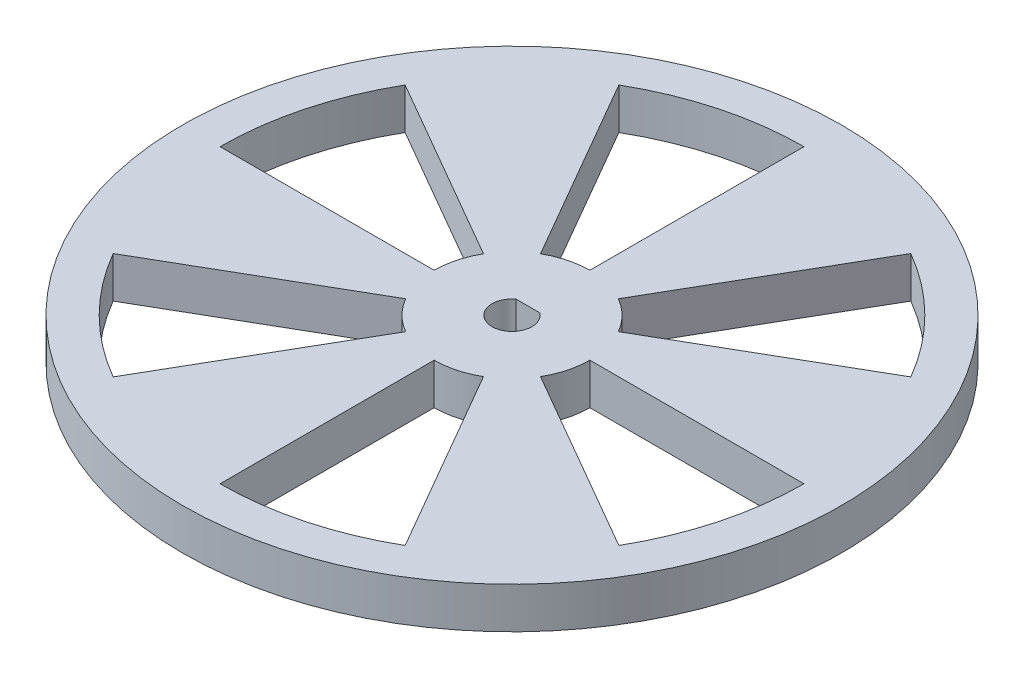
ISO-10303-21;
HEADER;
FILE_DESCRIPTION(('STEP AP214'),'2;1');
FILE_NAME('part.step','',(''),(''),'','','');
FILE_SCHEMA(('AUTOMOTIVE_DESIGN { 1 0 10303 214 1 1 1 1 }'));
ENDSEC;
DATA;
#1=APPLICATION_CONTEXT('core data for automotive mechanical design processes');
#2=APPLICATION_PROTOCOL_DEFINITION('international standard','automotive_design',2000,#1);
#3=PRODUCT_CONTEXT('',#1,'mechanical');
#4=PRODUCT('Part','Part','',(#3));
#5=PRODUCT_RELATED_PRODUCT_CATEGORY('part','',(#4));
#6=PRODUCT_DEFINITION_FORMATION('','',#4);
#7=PRODUCT_DEFINITION_CONTEXT('part definition',#1,'design');
#8=PRODUCT_DEFINITION('design','',#6,#7);
#9=PRODUCT_DEFINITION_SHAPE('','',#8);
#10=(LENGTH_UNIT() NAMED_UNIT(*) SI_UNIT(.MILLI.,.METRE.));
#11=(NAMED_UNIT(*) PLANE_ANGLE_UNIT() SI_UNIT($,.RADIAN.));
#12=(NAMED_UNIT(*) SI_UNIT($,.STERADIAN.) SOLID_ANGLE_UNIT());
#13=UNCERTAINTY_MEASURE_WITH_UNIT(LENGTH_MEASURE(1.E-05),#10,'distance_accuracy_value','');
#14=(GEOMETRIC_REPRESENTATION_CONTEXT(3) GLOBAL_UNCERTAINTY_ASSIGNED_CONTEXT((#13)) GLOBAL_UNIT_ASSIGNED_CONTEXT((#10,
#11,#12)) REPRESENTATION_CONTEXT('',''));
#15=CARTESIAN_POINT('',(0.,0.,0.));
#16=DIRECTION('',(0.,0.,1.));
#17=DIRECTION('',(1.,0.,0.));
#18=AXIS2_PLACEMENT_3D('',#15,#16,#17);
#19=CARTESIAN_POINT('',(0.,6.35,0.));
#20=DIRECTION('',(0.,1.,0.));
#21=DIRECTION('',(0.,0.,1.));
#22=AXIS2_PLACEMENT_3D('',#19,#20,#21);
#23=PLANE('',#22);
#24=DIRECTION('',(-0.499999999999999,0.,0.866025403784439));
#25=VECTOR('',#24,1.);
#26=CARTESIAN_POINT('',(5.99999999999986,6.35,-10.3923048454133));
#27=LINE('',#26,#25);
#28=CARTESIAN_POINT('',(22.4999999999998,6.35,-38.9711431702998));
#29=VERTEX_POINT('',#28);
#30=CARTESIAN_POINT('',(5.99999999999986,6.35,-10.3923048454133));
#31=VERTEX_POINT('',#30);
#32=EDGE_CURVE('E242',#29,#31,#27,.T.);
#33=ORIENTED_EDGE('',*,*,#32,.F.);
#34=CARTESIAN_POINT('',(0.,6.35,0.));
#35=DIRECTION('',(0.,1.,0.));
#36=DIRECTION('',(0.,0.,1.));
#37=AXIS2_PLACEMENT_3D('',#34,#35,#36);
#38=CIRCLE('',#37,45.);
#39=CARTESIAN_POINT('',(38.9711431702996,6.35,-22.5000000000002));
#40=VERTEX_POINT('',#39);
#41=EDGE_CURVE('E240',#40,#29,#38,.T.);
#42=ORIENTED_EDGE('',*,*,#41,.F.);
#43=DIRECTION('',(0.866025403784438,0.,-0.500000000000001));
#44=VECTOR('',#43,1.);
#45=CARTESIAN_POINT('',(10.3923048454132,6.35,-6.00000000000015));
#46=LINE('',#45,#44);
#47=CARTESIAN_POINT('',(10.3923048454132,6.35,-6.00000000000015));
#48=VERTEX_POINT('',#47);
#49=EDGE_CURVE('E248',#48,#40,#46,.T.);
#50=ORIENTED_EDGE('',*,*,#49,.F.);
#51=CARTESIAN_POINT('',(0.,6.35,0.));
#52=DIRECTION('',(0.,-1.,0.));
#53=DIRECTION('',(0.,0.,1.));
#54=AXIS2_PLACEMENT_3D('',#51,#52,#53);
#55=CIRCLE('',#54,12.);
#56=EDGE_CURVE('E245',#31,#48,#55,.T.);
#57=ORIENTED_EDGE('',*,*,#56,.F.);
#58=EDGE_LOOP('',(#33,#42,#50,#57));
#59=FACE_BOUND('',#58,.T.);
#60=DIRECTION('',(-1.,0.,0.));
#61=VECTOR('',#60,1.);
#62=CARTESIAN_POINT('',(1.83187666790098,6.35,-2.46356));
#63=LINE('',#62,#61);
#64=CARTESIAN_POINT('',(1.83187666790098,6.35,-2.46356));
#65=VERTEX_POINT('',#64);
#66=CARTESIAN_POINT('',(-1.83187666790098,6.35,-2.46356));
#67=VERTEX_POINT('',#66);
#68=EDGE_CURVE('E305',#65,#67,#63,.T.);
#69=ORIENTED_EDGE('',*,*,#68,.F.);
#70=CARTESIAN_POINT('',(0.,6.35,0.));
#71=DIRECTION('',(0.,1.,0.));
#72=DIRECTION('',(0.,0.,1.));
#73=AXIS2_PLACEMENT_3D('',#70,#71,#72);
#74=CIRCLE('',#73,3.07);
#75=EDGE_CURVE('E302',#67,#65,#74,.T.);
#76=ORIENTED_EDGE('',*,*,#75,.F.);
#77=EDGE_LOOP('',(#69,#76));
#78=FACE_BOUND('',#77,.T.);
#79=DIRECTION('',(0.5,0.,0.866025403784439));
#80=VECTOR('',#79,1.);
#81=CARTESIAN_POINT('',(-5.99999999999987,6.35,-10.3923048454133));
#82=LINE('',#81,#80);
#83=CARTESIAN_POINT('',(-22.4999999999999,6.35,-38.9711431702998));
#84=VERTEX_POINT('',#83);
#85=CARTESIAN_POINT('',(-5.99999999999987,6.35,-10.3923048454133));
#86=VERTEX_POINT('',#85);
#87=EDGE_CURVE('E352',#84,#86,#82,.T.);
#88=ORIENTED_EDGE('',*,*,#87,.F.);
#89=CARTESIAN_POINT('',(0.,6.35,0.));
#90=DIRECTION('',(0.,1.,0.));
#91=DIRECTION('',(0.,0.,1.));
#92=AXIS2_PLACEMENT_3D('',#89,#90,#91);
#93=CIRCLE('',#92,45.);
#94=CARTESIAN_POINT('',(-2.02076517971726E-13,6.35,-45.));
#95=VERTEX_POINT('',#94);
#96=EDGE_CURVE('E350',#95,#84,#93,.T.);
#97=ORIENTED_EDGE('',*,*,#96,.F.);
#98=DIRECTION('',(0.,0.,-1.));
#99=VECTOR('',#98,1.);
#100=CARTESIAN_POINT('',(-1.66061953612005E-13,6.35,-12.));
#101=LINE('',#100,#99);
#102=CARTESIAN_POINT('',(-1.66061953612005E-13,6.35,-12.));
#103=VERTEX_POINT('',#102);
#104=EDGE_CURVE('E358',#103,#95,#101,.T.);
#105=ORIENTED_EDGE('',*,*,#104,.F.);
#106=CARTESIAN_POINT('',(0.,6.35,0.));
#107=DIRECTION('',(0.,-1.,0.));
#108=DIRECTION('',(0.,0.,1.));
#109=AXIS2_PLACEMENT_3D('',#106,#107,#108);
#110=CIRCLE('',#109,12.);
#111=EDGE_CURVE('E355',#86,#103,#110,.T.);
#112=ORIENTED_EDGE('',*,*,#111,.F.);
#113=EDGE_LOOP('',(#88,#97,#105,#112));
#114=FACE_BOUND('',#113,.T.);
#115=CARTESIAN_POINT('',(0.,6.35,0.));
#116=DIRECTION('',(0.,1.,0.));
#117=DIRECTION('',(0.,0.,1.));
#118=AXIS2_PLACEMENT_3D('',#115,#116,#117);
#119=CIRCLE('',#118,50.8);
#120=CARTESIAN_POINT('',(0.,6.35,50.8));
#121=VERTEX_POINT('',#120);
#122=EDGE_CURVE('E11',#121,#121,#119,.T.);
#123=ORIENTED_EDGE('',*,*,#122,.T.);
#124=EDGE_LOOP('',(#123));
#125=FACE_BOUND('',#124,.T.);
#126=DIRECTION('',(-0.866025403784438,0.,0.500000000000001));
#127=VECTOR('',#126,1.);
#128=CARTESIAN_POINT('',(-10.3923048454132,6.35,6.00000000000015));
#129=LINE('',#128,#127);
#130=CARTESIAN_POINT('',(-10.3923048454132,6.35,6.00000000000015));
#131=VERTEX_POINT('',#130);
#132=CARTESIAN_POINT('',(-38.9711431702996,6.35,22.5000000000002));
#133=VERTEX_POINT('',#132);
#134=EDGE_CURVE('E383',#131,#133,#129,.T.);
#135=ORIENTED_EDGE('',*,*,#134,.F.);
#136=CARTESIAN_POINT('',(0.,6.35,0.));
#137=DIRECTION('',(0.,-1.,0.));
#138=DIRECTION('',(0.,0.,1.));
#139=AXIS2_PLACEMENT_3D('',#136,#137,#138);
#140=CIRCLE('',#139,12.);
#141=CARTESIAN_POINT('',(-5.99999999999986,6.35,10.3923048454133));
#142=VERTEX_POINT('',#141);
#143=EDGE_CURVE('E381',#142,#131,#140,.T.);
#144=ORIENTED_EDGE('',*,*,#143,.F.);
#145=DIRECTION('',(0.499999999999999,0.,-0.866025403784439));
#146=VECTOR('',#145,1.);
#147=CARTESIAN_POINT('',(-5.99999999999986,6.35,10.3923048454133));
#148=LINE('',#147,#146);
#149=CARTESIAN_POINT('',(-22.4999999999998,6.35,38.9711431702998));
#150=VERTEX_POINT('',#149);
#151=EDGE_CURVE('E389',#150,#142,#148,.T.);
#152=ORIENTED_EDGE('',*,*,#151,.F.);
#153=CARTESIAN_POINT('',(0.,6.35,0.));
#154=DIRECTION('',(0.,1.,0.));
#155=DIRECTION('',(0.,0.,1.));
#156=AXIS2_PLACEMENT_3D('',#153,#154,#155);
#157=CIRCLE('',#156,45.);
#158=EDGE_CURVE('E386',#133,#150,#157,.T.);
#159=ORIENTED_EDGE('',*,*,#158,.F.);
#160=EDGE_LOOP('',(#135,#144,#152,#159));
#161=FACE_BOUND('',#160,.T.);
#162=DIRECTION('',(-0.5,0.,-0.866025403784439));
#163=VECTOR('',#162,1.);
#164=CARTESIAN_POINT('',(5.99999999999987,6.35,10.3923048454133));
#165=LINE('',#164,#163);
#166=CARTESIAN_POINT('',(22.4999999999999,6.35,38.9711431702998));
#167=VERTEX_POINT('',#166);
#168=CARTESIAN_POINT('',(5.99999999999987,6.35,10.3923048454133));
#169=VERTEX_POINT('',#168);
#170=EDGE_CURVE('E321',#167,#169,#165,.T.);
#171=ORIENTED_EDGE('',*,*,#170,.F.);
#172=CARTESIAN_POINT('',(0.,6.35,0.));
#173=DIRECTION('',(0.,1.,0.));
#174=DIRECTION('',(0.,0.,1.));
#175=AXIS2_PLACEMENT_3D('',#172,#173,#174);
#176=CIRCLE('',#175,45.);
#177=CARTESIAN_POINT('',(1.77438635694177E-13,6.35,45.));
#178=VERTEX_POINT('',#177);
#179=EDGE_CURVE('E319',#178,#167,#176,.T.);
#180=ORIENTED_EDGE('',*,*,#179,.F.);
#181=DIRECTION('',(0.,0.,1.));
#182=VECTOR('',#181,1.);
#183=CARTESIAN_POINT('',(1.55030399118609E-13,6.35,12.));
#184=LINE('',#183,#182);
#185=CARTESIAN_POINT('',(1.55030399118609E-13,6.35,12.));
#186=VERTEX_POINT('',#185);
#187=EDGE_CURVE('E327',#186,#178,#184,.T.);
#188=ORIENTED_EDGE('',*,*,#187,.F.);
#189=CARTESIAN_POINT('',(0.,6.35,0.));
#190=DIRECTION('',(0.,-1.,0.));
#191=DIRECTION('',(0.,0.,1.));
#192=AXIS2_PLACEMENT_3D('',#189,#190,#191);
#193=CIRCLE('',#192,12.);
#194=EDGE_CURVE('E324',#169,#186,#193,.T.);
#195=ORIENTED_EDGE('',*,*,#194,.F.);
#196=EDGE_LOOP('',(#171,#180,#188,#195));
#197=FACE_BOUND('',#196,.T.);
#198=DIRECTION('',(1.,0.,0.));
#199=VECTOR('',#198,1.);
#200=CARTESIAN_POINT('',(-12.,6.35,-1.51746498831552E-13));
#201=LINE('',#200,#199);
#202=CARTESIAN_POINT('',(-45.,6.35,-1.57213080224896E-13));
#203=VERTEX_POINT('',#202);
#204=CARTESIAN_POINT('',(-12.,6.35,-1.51418265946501E-13));
#205=VERTEX_POINT('',#204);
#206=EDGE_CURVE('E273',#203,#205,#201,.T.);
#207=ORIENTED_EDGE('',*,*,#206,.F.);
#208=CARTESIAN_POINT('',(0.,6.35,0.));
#209=DIRECTION('',(0.,1.,0.));
#210=DIRECTION('',(0.,0.,1.));
#211=AXIS2_PLACEMENT_3D('',#208,#209,#210);
#212=CIRCLE('',#211,45.);
#213=CARTESIAN_POINT('',(-38.9711431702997,6.35,-22.5000000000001));
#214=VERTEX_POINT('',#213);
#215=EDGE_CURVE('E271',#214,#203,#212,.T.);
#216=ORIENTED_EDGE('',*,*,#215,.F.);
#217=DIRECTION('',(-0.866025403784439,0.,-0.5));
#218=VECTOR('',#217,1.);
#219=CARTESIAN_POINT('',(-10.3923048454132,6.35,-6.00000000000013));
#220=LINE('',#219,#218);
#221=CARTESIAN_POINT('',(-10.3923048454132,6.35,-6.00000000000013));
#222=VERTEX_POINT('',#221);
#223=EDGE_CURVE('E279',#222,#214,#220,.T.);
#224=ORIENTED_EDGE('',*,*,#223,.F.);
#225=CARTESIAN_POINT('',(0.,6.35,0.));
#226=DIRECTION('',(0.,-1.,0.));
#227=DIRECTION('',(0.,0.,1.));
#228=AXIS2_PLACEMENT_3D('',#225,#226,#227);
#229=CIRCLE('',#228,12.);
#230=EDGE_CURVE('E276',#205,#222,#229,.T.);
#231=ORIENTED_EDGE('',*,*,#230,.F.);
#232=EDGE_LOOP('',(#207,#216,#224,#231));
#233=FACE_BOUND('',#232,.T.);
#234=DIRECTION('',(0.866025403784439,0.,0.5));
#235=VECTOR('',#234,1.);
#236=CARTESIAN_POINT('',(10.3923048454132,6.35,6.00000000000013));
#237=LINE('',#236,#235);
#238=CARTESIAN_POINT('',(10.3923048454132,6.35,6.00000000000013));
#239=VERTEX_POINT('',#238);
#240=CARTESIAN_POINT('',(38.9711431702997,6.35,22.5000000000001));
#241=VERTEX_POINT('',#240);
#242=EDGE_CURVE('E212',#239,#241,#237,.T.);
#243=ORIENTED_EDGE('',*,*,#242,.F.);
#244=CARTESIAN_POINT('',(0.,6.35,0.));
#245=DIRECTION('',(0.,-1.,0.));
#246=DIRECTION('',(0.,0.,1.));
#247=AXIS2_PLACEMENT_3D('',#244,#245,#246);
#248=CIRCLE('',#247,12.);
#249=CARTESIAN_POINT('',(12.,6.35,1.55168499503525E-13));
#250=VERTEX_POINT('',#249);
#251=EDGE_CURVE('E204',#250,#239,#248,.T.);
#252=ORIENTED_EDGE('',*,*,#251,.F.);
#253=DIRECTION('',(-1.,0.,0.));
#254=VECTOR('',#253,1.);
#255=CARTESIAN_POINT('',(12.,6.35,1.55168499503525E-13));
#256=LINE('',#255,#254);
#257=CARTESIAN_POINT('',(45.,6.35,1.64430220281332E-13));
#258=VERTEX_POINT('',#257);
#259=EDGE_CURVE('E226',#258,#250,#256,.T.);
#260=ORIENTED_EDGE('',*,*,#259,.F.);
#261=CARTESIAN_POINT('',(0.,6.35,0.));
#262=DIRECTION('',(0.,1.,0.));
#263=DIRECTION('',(0.,0.,1.));
#264=AXIS2_PLACEMENT_3D('',#261,#262,#263);
#265=CIRCLE('',#264,45.);
#266=EDGE_CURVE('E224',#241,#258,#265,.T.);
#267=ORIENTED_EDGE('',*,*,#266,.F.);
#268=EDGE_LOOP('',(#243,#252,#260,#267));
#269=FACE_BOUND('',#268,.T.);
#270=ADVANCED_FACE('F31',(#59,#78,#114,#125,#161,#197,#233,#269),#23,.T.);
#271=CARTESIAN_POINT('',(0.,0.,0.));
#272=DIRECTION('',(0.,1.,0.));
#273=DIRECTION('',(0.,0.,1.));
#274=AXIS2_PLACEMENT_3D('',#271,#272,#273);
#275=PLANE('',#274);
#276=CARTESIAN_POINT('',(0.,0.,0.));
#277=DIRECTION('',(0.,1.,0.));
#278=DIRECTION('',(0.,0.,1.));
#279=AXIS2_PLACEMENT_3D('',#276,#277,#278);
#280=CIRCLE('',#279,45.);
#281=CARTESIAN_POINT('',(38.9711431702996,0.,-22.5000000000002));
#282=VERTEX_POINT('',#281);
#283=CARTESIAN_POINT('',(22.4999999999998,0.,-38.9711431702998));
#284=VERTEX_POINT('',#283);
#285=EDGE_CURVE('E220',#282,#284,#280,.T.);
#286=ORIENTED_EDGE('',*,*,#285,.T.);
#287=DIRECTION('',(-0.499999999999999,0.,0.866025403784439));
#288=VECTOR('',#287,1.);
#289=CARTESIAN_POINT('',(5.99999999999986,0.,-10.3923048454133));
#290=LINE('',#289,#288);
#291=CARTESIAN_POINT('',(5.99999999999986,0.,-10.3923048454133));
#292=VERTEX_POINT('',#291);
#293=EDGE_CURVE('E253',#284,#292,#290,.T.);
#294=ORIENTED_EDGE('',*,*,#293,.T.);
#295=CARTESIAN_POINT('',(0.,0.,0.));
#296=DIRECTION('',(0.,-1.,0.));
#297=DIRECTION('',(0.,0.,1.));
#298=AXIS2_PLACEMENT_3D('',#295,#296,#297);
#299=CIRCLE('',#298,12.);
#300=CARTESIAN_POINT('',(10.3923048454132,0.,-6.00000000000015));
#301=VERTEX_POINT('',#300);
#302=EDGE_CURVE('E256',#292,#301,#299,.T.);
#303=ORIENTED_EDGE('',*,*,#302,.T.);
#304=DIRECTION('',(0.866025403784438,0.,-0.500000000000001));
#305=VECTOR('',#304,1.);
#306=CARTESIAN_POINT('',(10.3923048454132,0.,-6.00000000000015));
#307=LINE('',#306,#305);
#308=EDGE_CURVE('E243',#301,#282,#307,.T.);
#309=ORIENTED_EDGE('',*,*,#308,.T.);
#310=EDGE_LOOP('',(#286,#294,#303,#309));
#311=FACE_BOUND('',#310,.T.);
#312=CARTESIAN_POINT('',(0.,0.,0.));
#313=DIRECTION('',(0.,1.,0.));
#314=DIRECTION('',(0.,0.,1.));
#315=AXIS2_PLACEMENT_3D('',#312,#313,#314);
#316=CIRCLE('',#315,3.07);
#317=CARTESIAN_POINT('',(-1.83187666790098,0.,-2.46356));
#318=VERTEX_POINT('',#317);
#319=CARTESIAN_POINT('',(1.83187666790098,0.,-2.46356));
#320=VERTEX_POINT('',#319);
#321=EDGE_CURVE('E301',#318,#320,#316,.T.);
#322=ORIENTED_EDGE('',*,*,#321,.T.);
#323=DIRECTION('',(-1.,0.,0.));
#324=VECTOR('',#323,1.);
#325=CARTESIAN_POINT('',(1.83187666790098,0.,-2.46356));
#326=LINE('',#325,#324);
#327=EDGE_CURVE('E306',#320,#318,#326,.T.);
#328=ORIENTED_EDGE('',*,*,#327,.T.);
#329=EDGE_LOOP('',(#322,#328));
#330=FACE_BOUND('',#329,.T.);
#331=CARTESIAN_POINT('',(0.,0.,0.));
#332=DIRECTION('',(0.,1.,0.));
#333=DIRECTION('',(0.,0.,1.));
#334=AXIS2_PLACEMENT_3D('',#331,#332,#333);
#335=CIRCLE('',#334,45.);
#336=CARTESIAN_POINT('',(-2.02076517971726E-13,0.,-45.));
#337=VERTEX_POINT('',#336);
#338=CARTESIAN_POINT('',(-22.4999999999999,0.,-38.9711431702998));
#339=VERTEX_POINT('',#338);
#340=EDGE_CURVE('E349',#337,#339,#335,.T.);
#341=ORIENTED_EDGE('',*,*,#340,.T.);
#342=DIRECTION('',(0.5,0.,0.866025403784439));
#343=VECTOR('',#342,1.);
#344=CARTESIAN_POINT('',(-5.99999999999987,0.,-10.3923048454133));
#345=LINE('',#344,#343);
#346=CARTESIAN_POINT('',(-5.99999999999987,0.,-10.3923048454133));
#347=VERTEX_POINT('',#346);
#348=EDGE_CURVE('E363',#339,#347,#345,.T.);
#349=ORIENTED_EDGE('',*,*,#348,.T.);
#350=CARTESIAN_POINT('',(0.,0.,0.));
#351=DIRECTION('',(0.,-1.,0.));
#352=DIRECTION('',(0.,0.,1.));
#353=AXIS2_PLACEMENT_3D('',#350,#351,#352);
#354=CIRCLE('',#353,12.);
#355=CARTESIAN_POINT('',(-1.63731658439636E-13,0.,-12.));
#356=VERTEX_POINT('',#355);
#357=EDGE_CURVE('E366',#347,#356,#354,.T.);
#358=ORIENTED_EDGE('',*,*,#357,.T.);
#359=DIRECTION('',(0.,0.,-1.));
#360=VECTOR('',#359,1.);
#361=CARTESIAN_POINT('',(-1.66061953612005E-13,0.,-12.));
#362=LINE('',#361,#360);
#363=EDGE_CURVE('E353',#356,#337,#362,.T.);
#364=ORIENTED_EDGE('',*,*,#363,.T.);
#365=EDGE_LOOP('',(#341,#349,#358,#364));
#366=FACE_BOUND('',#365,.T.);
#367=CARTESIAN_POINT('',(0.,0.,0.));
#368=DIRECTION('',(0.,1.,0.));
#369=DIRECTION('',(0.,0.,1.));
#370=AXIS2_PLACEMENT_3D('',#367,#368,#369);
#371=CIRCLE('',#370,50.8);
#372=CARTESIAN_POINT('',(0.,0.,50.8));
#373=VERTEX_POINT('',#372);
#374=EDGE_CURVE('E35',#373,#373,#371,.T.);
#375=ORIENTED_EDGE('',*,*,#374,.F.);
#376=EDGE_LOOP('',(#375));
#377=FACE_BOUND('',#376,.T.);
#378=CARTESIAN_POINT('',(0.,0.,0.));
#379=DIRECTION('',(0.,-1.,0.));
#380=DIRECTION('',(0.,0.,1.));
#381=AXIS2_PLACEMENT_3D('',#378,#379,#380);
#382=CIRCLE('',#381,12.);
#383=CARTESIAN_POINT('',(-5.99999999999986,0.,10.3923048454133));
#384=VERTEX_POINT('',#383);
#385=CARTESIAN_POINT('',(-10.3923048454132,0.,6.00000000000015));
#386=VERTEX_POINT('',#385);
#387=EDGE_CURVE('E380',#384,#386,#382,.T.);
#388=ORIENTED_EDGE('',*,*,#387,.T.);
#389=DIRECTION('',(-0.866025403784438,0.,0.500000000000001));
#390=VECTOR('',#389,1.);
#391=CARTESIAN_POINT('',(-10.3923048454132,0.,6.00000000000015));
#392=LINE('',#391,#390);
#393=CARTESIAN_POINT('',(-38.9711431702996,0.,22.5000000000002));
#394=VERTEX_POINT('',#393);
#395=EDGE_CURVE('E394',#386,#394,#392,.T.);
#396=ORIENTED_EDGE('',*,*,#395,.T.);
#397=CARTESIAN_POINT('',(0.,0.,0.));
#398=DIRECTION('',(0.,1.,0.));
#399=DIRECTION('',(0.,0.,1.));
#400=AXIS2_PLACEMENT_3D('',#397,#398,#399);
#401=CIRCLE('',#400,45.);
#402=CARTESIAN_POINT('',(-22.4999999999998,0.,38.9711431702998));
#403=VERTEX_POINT('',#402);
#404=EDGE_CURVE('E397',#394,#403,#401,.T.);
#405=ORIENTED_EDGE('',*,*,#404,.T.);
#406=DIRECTION('',(0.499999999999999,0.,-0.866025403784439));
#407=VECTOR('',#406,1.);
#408=CARTESIAN_POINT('',(-5.99999999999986,0.,10.3923048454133));
#409=LINE('',#408,#407);
#410=EDGE_CURVE('E384',#403,#384,#409,.T.);
#411=ORIENTED_EDGE('',*,*,#410,.T.);
#412=EDGE_LOOP('',(#388,#396,#405,#411));
#413=FACE_BOUND('',#412,.T.);
#414=CARTESIAN_POINT('',(0.,0.,0.));
#415=DIRECTION('',(0.,1.,0.));
#416=DIRECTION('',(0.,0.,1.));
#417=AXIS2_PLACEMENT_3D('',#414,#415,#416);
#418=CIRCLE('',#417,45.);
#419=CARTESIAN_POINT('',(1.77438635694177E-13,0.,45.));
#420=VERTEX_POINT('',#419);
#421=CARTESIAN_POINT('',(22.4999999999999,0.,38.9711431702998));
#422=VERTEX_POINT('',#421);
#423=EDGE_CURVE('E318',#420,#422,#418,.T.);
#424=ORIENTED_EDGE('',*,*,#423,.T.);
#425=DIRECTION('',(-0.5,0.,-0.866025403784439));
#426=VECTOR('',#425,1.);
#427=CARTESIAN_POINT('',(5.99999999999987,0.,10.3923048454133));
#428=LINE('',#427,#426);
#429=CARTESIAN_POINT('',(5.99999999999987,0.,10.3923048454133));
#430=VERTEX_POINT('',#429);
#431=EDGE_CURVE('E332',#422,#430,#428,.T.);
#432=ORIENTED_EDGE('',*,*,#431,.T.);
#433=CARTESIAN_POINT('',(0.,0.,0.));
#434=DIRECTION('',(0.,-1.,0.));
#435=DIRECTION('',(0.,0.,1.));
#436=AXIS2_PLACEMENT_3D('',#433,#434,#435);
#437=CIRCLE('',#436,12.);
#438=CARTESIAN_POINT('',(1.55030399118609E-13,0.,12.));
#439=VERTEX_POINT('',#438);
#440=EDGE_CURVE('E335',#430,#439,#437,.T.);
#441=ORIENTED_EDGE('',*,*,#440,.T.);
#442=DIRECTION('',(0.,0.,1.));
#443=VECTOR('',#442,1.);
#444=CARTESIAN_POINT('',(1.55030399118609E-13,0.,12.));
#445=LINE('',#444,#443);
#446=EDGE_CURVE('E322',#439,#420,#445,.T.);
#447=ORIENTED_EDGE('',*,*,#446,.T.);
#448=EDGE_LOOP('',(#424,#432,#441,#447));
#449=FACE_BOUND('',#448,.T.);
#450=CARTESIAN_POINT('',(0.,0.,0.));
#451=DIRECTION('',(0.,1.,0.));
#452=DIRECTION('',(0.,0.,1.));
#453=AXIS2_PLACEMENT_3D('',#450,#451,#452);
#454=CIRCLE('',#453,45.);
#455=CARTESIAN_POINT('',(-38.9711431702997,0.,-22.5000000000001));
#456=VERTEX_POINT('',#455);
#457=CARTESIAN_POINT('',(-45.,0.,-1.57213080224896E-13));
#458=VERTEX_POINT('',#457);
#459=EDGE_CURVE('E270',#456,#458,#454,.T.);
#460=ORIENTED_EDGE('',*,*,#459,.T.);
#461=DIRECTION('',(1.,0.,0.));
#462=VECTOR('',#461,1.);
#463=CARTESIAN_POINT('',(-12.,0.,-1.51746498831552E-13));
#464=LINE('',#463,#462);
#465=CARTESIAN_POINT('',(-12.,0.,-1.51418265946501E-13));
#466=VERTEX_POINT('',#465);
#467=EDGE_CURVE('E284',#458,#466,#464,.T.);
#468=ORIENTED_EDGE('',*,*,#467,.T.);
#469=CARTESIAN_POINT('',(0.,0.,0.));
#470=DIRECTION('',(0.,-1.,0.));
#471=DIRECTION('',(0.,0.,1.));
#472=AXIS2_PLACEMENT_3D('',#469,#470,#471);
#473=CIRCLE('',#472,12.);
#474=CARTESIAN_POINT('',(-10.3923048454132,0.,-6.00000000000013));
#475=VERTEX_POINT('',#474);
#476=EDGE_CURVE('E287',#466,#475,#473,.T.);
#477=ORIENTED_EDGE('',*,*,#476,.T.);
#478=DIRECTION('',(-0.866025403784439,0.,-0.5));
#479=VECTOR('',#478,1.);
#480=CARTESIAN_POINT('',(-10.3923048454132,0.,-6.00000000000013));
#481=LINE('',#480,#479);
#482=EDGE_CURVE('E274',#475,#456,#481,.T.);
#483=ORIENTED_EDGE('',*,*,#482,.T.);
#484=EDGE_LOOP('',(#460,#468,#477,#483));
#485=FACE_BOUND('',#484,.T.);
#486=CARTESIAN_POINT('',(0.,0.,0.));
#487=DIRECTION('',(0.,-1.,0.));
#488=DIRECTION('',(0.,0.,1.));
#489=AXIS2_PLACEMENT_3D('',#486,#487,#488);
#490=CIRCLE('',#489,12.);
#491=CARTESIAN_POINT('',(12.,0.,1.55168499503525E-13));
#492=VERTEX_POINT('',#491);
#493=CARTESIAN_POINT('',(10.3923048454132,0.,6.00000000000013));
#494=VERTEX_POINT('',#493);
#495=EDGE_CURVE('E54',#492,#494,#490,.T.);
#496=ORIENTED_EDGE('',*,*,#495,.T.);
#497=DIRECTION('',(0.866025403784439,0.,0.5));
#498=VECTOR('',#497,1.);
#499=CARTESIAN_POINT('',(10.3923048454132,0.,6.00000000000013));
#500=LINE('',#499,#498);
#501=CARTESIAN_POINT('',(38.9711431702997,0.,22.5000000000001));
#502=VERTEX_POINT('',#501);
#503=EDGE_CURVE('E219',#494,#502,#500,.T.);
#504=ORIENTED_EDGE('',*,*,#503,.T.);
#505=CARTESIAN_POINT('',(0.,0.,0.));
#506=DIRECTION('',(0.,1.,0.));
#507=DIRECTION('',(0.,0.,1.));
#508=AXIS2_PLACEMENT_3D('',#505,#506,#507);
#509=CIRCLE('',#508,45.);
#510=CARTESIAN_POINT('',(45.,0.,1.64430220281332E-13));
#511=VERTEX_POINT('',#510);
#512=EDGE_CURVE('E232',#502,#511,#509,.T.);
#513=ORIENTED_EDGE('',*,*,#512,.T.);
#514=DIRECTION('',(-1.,0.,0.));
#515=VECTOR('',#514,1.);
#516=CARTESIAN_POINT('',(12.,0.,1.55168499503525E-13));
#517=LINE('',#516,#515);
#518=EDGE_CURVE('E213',#511,#492,#517,.T.);
#519=ORIENTED_EDGE('',*,*,#518,.T.);
#520=EDGE_LOOP('',(#496,#504,#513,#519));
#521=FACE_BOUND('',#520,.T.);
#522=ADVANCED_FACE('F416',(#311,#330,#366,#377,#413,#449,#485,#521),#275,.F.);
#523=CARTESIAN_POINT('',(0.,6.35,0.));
#524=DIRECTION('',(0.,-1.,0.));
#525=DIRECTION('',(0.,0.,-1.));
#526=AXIS2_PLACEMENT_3D('',#523,#524,#525);
#527=CYLINDRICAL_SURFACE('',#526,50.8);
#528=ORIENTED_EDGE('',*,*,#122,.F.);
#529=EDGE_LOOP('',(#528));
#530=FACE_BOUND('',#529,.T.);
#531=ORIENTED_EDGE('',*,*,#374,.T.);
#532=EDGE_LOOP('',(#531));
#533=FACE_BOUND('',#532,.T.);
#534=ADVANCED_FACE('F33',(#530,#533),#527,.T.);
#535=CARTESIAN_POINT('',(0.,6.35,0.));
#536=DIRECTION('',(0.,-1.,0.));
#537=DIRECTION('',(0.,0.,-1.));
#538=AXIS2_PLACEMENT_3D('',#535,#536,#537);
#539=CYLINDRICAL_SURFACE('',#538,12.);
#540=ORIENTED_EDGE('',*,*,#387,.F.);
#541=DIRECTION('',(0.,-1.,0.));
#542=VECTOR('',#541,1.);
#543=CARTESIAN_POINT('',(-5.99999999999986,6.35,10.3923048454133));
#544=LINE('',#543,#542);
#545=EDGE_CURVE('E391',#142,#384,#544,.T.);
#546=ORIENTED_EDGE('',*,*,#545,.F.);
#547=ORIENTED_EDGE('',*,*,#143,.T.);
#548=DIRECTION('',(0.,-1.,0.));
#549=VECTOR('',#548,1.);
#550=CARTESIAN_POINT('',(-10.3923048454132,6.35,6.00000000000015));
#551=LINE('',#550,#549);
#552=EDGE_CURVE('E408',#131,#386,#551,.T.);
#553=ORIENTED_EDGE('',*,*,#552,.T.);
#554=EDGE_LOOP('',(#540,#546,#547,#553));
#555=FACE_BOUND('',#554,.T.);
#556=ADVANCED_FACE('F441',(#555),#539,.T.);
#557=CARTESIAN_POINT('',(-10.3923048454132,6.35,6.00000000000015));
#558=DIRECTION('',(0.500000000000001,0.,0.866025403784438));
#559=DIRECTION('',(0.866025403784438,0.,-0.500000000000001));
#560=AXIS2_PLACEMENT_3D('',#557,#558,#559);
#561=PLANE('',#560);
#562=ORIENTED_EDGE('',*,*,#395,.F.);
#563=ORIENTED_EDGE('',*,*,#552,.F.);
#564=ORIENTED_EDGE('',*,*,#134,.T.);
#565=DIRECTION('',(0.,-1.,0.));
#566=VECTOR('',#565,1.);
#567=CARTESIAN_POINT('',(-38.9711431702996,6.35,22.5000000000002));
#568=LINE('',#567,#566);
#569=EDGE_CURVE('E406',#133,#394,#568,.T.);
#570=ORIENTED_EDGE('',*,*,#569,.T.);
#571=EDGE_LOOP('',(#562,#563,#564,#570));
#572=FACE_BOUND('',#571,.T.);
#573=ADVANCED_FACE('F444',(#572),#561,.T.);
#574=CARTESIAN_POINT('',(0.,6.35,0.));
#575=DIRECTION('',(0.,-1.,0.));
#576=DIRECTION('',(0.,0.,-1.));
#577=AXIS2_PLACEMENT_3D('',#574,#575,#576);
#578=CYLINDRICAL_SURFACE('',#577,45.);
#579=ORIENTED_EDGE('',*,*,#404,.F.);
#580=ORIENTED_EDGE('',*,*,#569,.F.);
#581=ORIENTED_EDGE('',*,*,#158,.T.);
#582=DIRECTION('',(0.,-1.,0.));
#583=VECTOR('',#582,1.);
#584=CARTESIAN_POINT('',(-22.4999999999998,6.35,38.9711431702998));
#585=LINE('',#584,#583);
#586=EDGE_CURVE('E404',#150,#403,#585,.T.);
#587=ORIENTED_EDGE('',*,*,#586,.T.);
#588=EDGE_LOOP('',(#579,#580,#581,#587));
#589=FACE_BOUND('',#588,.T.);
#590=ADVANCED_FACE('F447',(#589),#578,.F.);
#591=CARTESIAN_POINT('',(-5.99999999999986,6.35,10.3923048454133));
#592=DIRECTION('',(-0.866025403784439,0.,-0.499999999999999));
#593=DIRECTION('',(-0.499999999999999,0.,0.866025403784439));
#594=AXIS2_PLACEMENT_3D('',#591,#592,#593);
#595=PLANE('',#594);
#596=ORIENTED_EDGE('',*,*,#410,.F.);
#597=ORIENTED_EDGE('',*,*,#586,.F.);
#598=ORIENTED_EDGE('',*,*,#151,.T.);
#599=ORIENTED_EDGE('',*,*,#545,.T.);
#600=EDGE_LOOP('',(#596,#597,#598,#599));
#601=FACE_BOUND('',#600,.T.);
#602=ADVANCED_FACE('F451',(#601),#595,.T.);
#603=CARTESIAN_POINT('',(0.,6.35,0.));
#604=DIRECTION('',(0.,-1.,0.));
#605=DIRECTION('',(0.,0.,-1.));
#606=AXIS2_PLACEMENT_3D('',#603,#604,#605);
#607=CYLINDRICAL_SURFACE('',#606,45.);
#608=ORIENTED_EDGE('',*,*,#340,.F.);
#609=DIRECTION('',(0.,-1.,0.));
#610=VECTOR('',#609,1.);
#611=CARTESIAN_POINT('',(-2.02076517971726E-13,6.35,-45.));
#612=LINE('',#611,#610);
#613=EDGE_CURVE('E360',#95,#337,#612,.T.);
#614=ORIENTED_EDGE('',*,*,#613,.F.);
#615=ORIENTED_EDGE('',*,*,#96,.T.);
#616=DIRECTION('',(0.,-1.,0.));
#617=VECTOR('',#616,1.);
#618=CARTESIAN_POINT('',(-22.4999999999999,6.35,-38.9711431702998));
#619=LINE('',#618,#617);
#620=EDGE_CURVE('E377',#84,#339,#619,.T.);
#621=ORIENTED_EDGE('',*,*,#620,.T.);
#622=EDGE_LOOP('',(#608,#614,#615,#621));
#623=FACE_BOUND('',#622,.T.);
#624=ADVANCED_FACE('F455',(#623),#607,.F.);
#625=CARTESIAN_POINT('',(-5.99999999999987,6.35,-10.3923048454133));
#626=DIRECTION('',(0.866025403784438,0.,-0.5));
#627=DIRECTION('',(-0.5,0.,-0.866025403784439));
#628=AXIS2_PLACEMENT_3D('',#625,#626,#627);
#629=PLANE('',#628);
#630=ORIENTED_EDGE('',*,*,#348,.F.);
#631=ORIENTED_EDGE('',*,*,#620,.F.);
#632=ORIENTED_EDGE('',*,*,#87,.T.);
#633=DIRECTION('',(0.,-1.,0.));
#634=VECTOR('',#633,1.);
#635=CARTESIAN_POINT('',(-5.99999999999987,6.35,-10.3923048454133));
#636=LINE('',#635,#634);
#637=EDGE_CURVE('E375',#86,#347,#636,.T.);
#638=ORIENTED_EDGE('',*,*,#637,.T.);
#639=EDGE_LOOP('',(#630,#631,#632,#638));
#640=FACE_BOUND('',#639,.T.);
#641=ADVANCED_FACE('F459',(#640),#629,.T.);
#642=CARTESIAN_POINT('',(0.,6.35,0.));
#643=DIRECTION('',(0.,-1.,0.));
#644=DIRECTION('',(0.,0.,-1.));
#645=AXIS2_PLACEMENT_3D('',#642,#643,#644);
#646=CYLINDRICAL_SURFACE('',#645,12.);
#647=ORIENTED_EDGE('',*,*,#357,.F.);
#648=ORIENTED_EDGE('',*,*,#637,.F.);
#649=ORIENTED_EDGE('',*,*,#111,.T.);
#650=DIRECTION('',(0.,-1.,0.));
#651=VECTOR('',#650,1.);
#652=CARTESIAN_POINT('',(-1.63731658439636E-13,6.35,-12.));
#653=LINE('',#652,#651);
#654=EDGE_CURVE('E373',#103,#356,#653,.T.);
#655=ORIENTED_EDGE('',*,*,#654,.T.);
#656=EDGE_LOOP('',(#647,#648,#649,#655));
#657=FACE_BOUND('',#656,.T.);
#658=ADVANCED_FACE('F463',(#657),#646,.T.);
#659=CARTESIAN_POINT('',(-1.66061953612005E-13,6.35,-12.));
#660=DIRECTION('',(-1.,0.,0.));
#661=DIRECTION('',(0.,0.,1.));
#662=AXIS2_PLACEMENT_3D('',#659,#660,#661);
#663=PLANE('',#662);
#664=ORIENTED_EDGE('',*,*,#363,.F.);
#665=ORIENTED_EDGE('',*,*,#654,.F.);
#666=ORIENTED_EDGE('',*,*,#104,.T.);
#667=ORIENTED_EDGE('',*,*,#613,.T.);
#668=EDGE_LOOP('',(#664,#665,#666,#667));
#669=FACE_BOUND('',#668,.T.);
#670=ADVANCED_FACE('F467',(#669),#663,.T.);
#671=CARTESIAN_POINT('',(0.,6.35,0.));
#672=DIRECTION('',(0.,-1.,0.));
#673=DIRECTION('',(0.,0.,-1.));
#674=AXIS2_PLACEMENT_3D('',#671,#672,#673);
#675=CYLINDRICAL_SURFACE('',#674,45.);
#676=ORIENTED_EDGE('',*,*,#423,.F.);
#677=DIRECTION('',(0.,-1.,0.));
#678=VECTOR('',#677,1.);
#679=CARTESIAN_POINT('',(1.77438635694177E-13,6.35,45.));
#680=LINE('',#679,#678);
#681=EDGE_CURVE('E329',#178,#420,#680,.T.);
#682=ORIENTED_EDGE('',*,*,#681,.F.);
#683=ORIENTED_EDGE('',*,*,#179,.T.);
#684=DIRECTION('',(0.,-1.,0.));
#685=VECTOR('',#684,1.);
#686=CARTESIAN_POINT('',(22.4999999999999,6.35,38.9711431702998));
#687=LINE('',#686,#685);
#688=EDGE_CURVE('E346',#167,#422,#687,.T.);
#689=ORIENTED_EDGE('',*,*,#688,.T.);
#690=EDGE_LOOP('',(#676,#682,#683,#689));
#691=FACE_BOUND('',#690,.T.);
#692=ADVANCED_FACE('F471',(#691),#675,.F.);
#693=CARTESIAN_POINT('',(5.99999999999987,6.35,10.3923048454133));
#694=DIRECTION('',(-0.866025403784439,0.,0.5));
#695=DIRECTION('',(0.5,0.,0.866025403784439));
#696=AXIS2_PLACEMENT_3D('',#693,#694,#695);
#697=PLANE('',#696);
#698=ORIENTED_EDGE('',*,*,#431,.F.);
#699=ORIENTED_EDGE('',*,*,#688,.F.);
#700=ORIENTED_EDGE('',*,*,#170,.T.);
#701=DIRECTION('',(0.,-1.,0.));
#702=VECTOR('',#701,1.);
#703=CARTESIAN_POINT('',(5.99999999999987,6.35,10.3923048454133));
#704=LINE('',#703,#702);
#705=EDGE_CURVE('E344',#169,#430,#704,.T.);
#706=ORIENTED_EDGE('',*,*,#705,.T.);
#707=EDGE_LOOP('',(#698,#699,#700,#706));
#708=FACE_BOUND('',#707,.T.);
#709=ADVANCED_FACE('F475',(#708),#697,.T.);
#710=CARTESIAN_POINT('',(0.,6.35,0.));
#711=DIRECTION('',(0.,-1.,0.));
#712=DIRECTION('',(0.,0.,-1.));
#713=AXIS2_PLACEMENT_3D('',#710,#711,#712);
#714=CYLINDRICAL_SURFACE('',#713,12.);
#715=ORIENTED_EDGE('',*,*,#440,.F.);
#716=ORIENTED_EDGE('',*,*,#705,.F.);
#717=ORIENTED_EDGE('',*,*,#194,.T.);
#718=DIRECTION('',(0.,-1.,0.));
#719=VECTOR('',#718,1.);
#720=CARTESIAN_POINT('',(1.55030399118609E-13,6.35,12.));
#721=LINE('',#720,#719);
#722=EDGE_CURVE('E342',#186,#439,#721,.T.);
#723=ORIENTED_EDGE('',*,*,#722,.T.);
#724=EDGE_LOOP('',(#715,#716,#717,#723));
#725=FACE_BOUND('',#724,.T.);
#726=ADVANCED_FACE('F479',(#725),#714,.T.);
#727=CARTESIAN_POINT('',(1.55030399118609E-13,6.35,12.));
#728=DIRECTION('',(1.,0.,0.));
#729=DIRECTION('',(0.,0.,-1.));
#730=AXIS2_PLACEMENT_3D('',#727,#728,#729);
#731=PLANE('',#730);
#732=ORIENTED_EDGE('',*,*,#446,.F.);
#733=ORIENTED_EDGE('',*,*,#722,.F.);
#734=ORIENTED_EDGE('',*,*,#187,.T.);
#735=ORIENTED_EDGE('',*,*,#681,.T.);
#736=EDGE_LOOP('',(#732,#733,#734,#735));
#737=FACE_BOUND('',#736,.T.);
#738=ADVANCED_FACE('F483',(#737),#731,.T.);
#739=CARTESIAN_POINT('',(0.,6.35,0.));
#740=DIRECTION('',(0.,-1.,0.));
#741=DIRECTION('',(0.,0.,-1.));
#742=AXIS2_PLACEMENT_3D('',#739,#740,#741);
#743=CYLINDRICAL_SURFACE('',#742,3.07);
#744=ORIENTED_EDGE('',*,*,#321,.F.);
#745=DIRECTION('',(0.,-1.,0.));
#746=VECTOR('',#745,1.);
#747=CARTESIAN_POINT('',(-1.83187666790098,6.35,-2.46356));
#748=LINE('',#747,#746);
#749=EDGE_CURVE('E308',#67,#318,#748,.T.);
#750=ORIENTED_EDGE('',*,*,#749,.F.);
#751=ORIENTED_EDGE('',*,*,#75,.T.);
#752=DIRECTION('',(0.,-1.,0.));
#753=VECTOR('',#752,1.);
#754=CARTESIAN_POINT('',(1.83187666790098,6.35,-2.46356));
#755=LINE('',#754,#753);
#756=EDGE_CURVE('E315',#65,#320,#755,.T.);
#757=ORIENTED_EDGE('',*,*,#756,.T.);
#758=EDGE_LOOP('',(#744,#750,#751,#757));
#759=FACE_BOUND('',#758,.T.);
#760=ADVANCED_FACE('F487',(#759),#743,.F.);
#761=CARTESIAN_POINT('',(1.83187666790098,6.35,-2.46356));
#762=DIRECTION('',(0.,0.,1.));
#763=DIRECTION('',(1.,0.,0.));
#764=AXIS2_PLACEMENT_3D('',#761,#762,#763);
#765=PLANE('',#764);
#766=ORIENTED_EDGE('',*,*,#327,.F.);
#767=ORIENTED_EDGE('',*,*,#756,.F.);
#768=ORIENTED_EDGE('',*,*,#68,.T.);
#769=ORIENTED_EDGE('',*,*,#749,.T.);
#770=EDGE_LOOP('',(#766,#767,#768,#769));
#771=FACE_BOUND('',#770,.T.);
#772=ADVANCED_FACE('F491',(#771),#765,.T.);
#773=CARTESIAN_POINT('',(0.,6.35,0.));
#774=DIRECTION('',(0.,-1.,0.));
#775=DIRECTION('',(0.,0.,-1.));
#776=AXIS2_PLACEMENT_3D('',#773,#774,#775);
#777=CYLINDRICAL_SURFACE('',#776,45.);
#778=ORIENTED_EDGE('',*,*,#459,.F.);
#779=DIRECTION('',(0.,-1.,0.));
#780=VECTOR('',#779,1.);
#781=CARTESIAN_POINT('',(-38.9711431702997,6.35,-22.5000000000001));
#782=LINE('',#781,#780);
#783=EDGE_CURVE('E281',#214,#456,#782,.T.);
#784=ORIENTED_EDGE('',*,*,#783,.F.);
#785=ORIENTED_EDGE('',*,*,#215,.T.);
#786=DIRECTION('',(0.,-1.,0.));
#787=VECTOR('',#786,1.);
#788=CARTESIAN_POINT('',(-45.,6.35,-1.57213080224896E-13));
#789=LINE('',#788,#787);
#790=EDGE_CURVE('E298',#203,#458,#789,.T.);
#791=ORIENTED_EDGE('',*,*,#790,.T.);
#792=EDGE_LOOP('',(#778,#784,#785,#791));
#793=FACE_BOUND('',#792,.T.);
#794=ADVANCED_FACE('F495',(#793),#777,.F.);
#795=CARTESIAN_POINT('',(-12.,6.35,-1.51746498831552E-13));
#796=DIRECTION('',(0.,0.,-1.));
#797=DIRECTION('',(-1.,0.,0.));
#798=AXIS2_PLACEMENT_3D('',#795,#796,#797);
#799=PLANE('',#798);
#800=ORIENTED_EDGE('',*,*,#467,.F.);
#801=ORIENTED_EDGE('',*,*,#790,.F.);
#802=ORIENTED_EDGE('',*,*,#206,.T.);
#803=DIRECTION('',(0.,-1.,0.));
#804=VECTOR('',#803,1.);
#805=CARTESIAN_POINT('',(-12.,6.35,-1.51418265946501E-13));
#806=LINE('',#805,#804);
#807=EDGE_CURVE('E296',#205,#466,#806,.T.);
#808=ORIENTED_EDGE('',*,*,#807,.T.);
#809=EDGE_LOOP('',(#800,#801,#802,#808));
#810=FACE_BOUND('',#809,.T.);
#811=ADVANCED_FACE('F499',(#810),#799,.T.);
#812=CARTESIAN_POINT('',(0.,6.35,0.));
#813=DIRECTION('',(0.,-1.,0.));
#814=DIRECTION('',(0.,0.,-1.));
#815=AXIS2_PLACEMENT_3D('',#812,#813,#814);
#816=CYLINDRICAL_SURFACE('',#815,12.);
#817=ORIENTED_EDGE('',*,*,#476,.F.);
#818=ORIENTED_EDGE('',*,*,#807,.F.);
#819=ORIENTED_EDGE('',*,*,#230,.T.);
#820=DIRECTION('',(0.,-1.,0.));
#821=VECTOR('',#820,1.);
#822=CARTESIAN_POINT('',(-10.3923048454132,6.35,-6.00000000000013));
#823=LINE('',#822,#821);
#824=EDGE_CURVE('E294',#222,#475,#823,.T.);
#825=ORIENTED_EDGE('',*,*,#824,.T.);
#826=EDGE_LOOP('',(#817,#818,#819,#825));
#827=FACE_BOUND('',#826,.T.);
#828=ADVANCED_FACE('F503',(#827),#816,.T.);
#829=CARTESIAN_POINT('',(-10.3923048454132,6.35,-6.00000000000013));
#830=DIRECTION('',(-0.5,0.,0.866025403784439));
#831=DIRECTION('',(0.866025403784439,0.,0.5));
#832=AXIS2_PLACEMENT_3D('',#829,#830,#831);
#833=PLANE('',#832);
#834=ORIENTED_EDGE('',*,*,#482,.F.);
#835=ORIENTED_EDGE('',*,*,#824,.F.);
#836=ORIENTED_EDGE('',*,*,#223,.T.);
#837=ORIENTED_EDGE('',*,*,#783,.T.);
#838=EDGE_LOOP('',(#834,#835,#836,#837));
#839=FACE_BOUND('',#838,.T.);
#840=ADVANCED_FACE('F507',(#839),#833,.T.);
#841=CARTESIAN_POINT('',(0.,6.35,0.));
#842=DIRECTION('',(0.,-1.,0.));
#843=DIRECTION('',(0.,0.,-1.));
#844=AXIS2_PLACEMENT_3D('',#841,#842,#843);
#845=CYLINDRICAL_SURFACE('',#844,45.);
#846=ORIENTED_EDGE('',*,*,#285,.F.);
#847=DIRECTION('',(0.,-1.,0.));
#848=VECTOR('',#847,1.);
#849=CARTESIAN_POINT('',(38.9711431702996,6.35,-22.5000000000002));
#850=LINE('',#849,#848);
#851=EDGE_CURVE('E250',#40,#282,#850,.T.);
#852=ORIENTED_EDGE('',*,*,#851,.F.);
#853=ORIENTED_EDGE('',*,*,#41,.T.);
#854=DIRECTION('',(0.,-1.,0.));
#855=VECTOR('',#854,1.);
#856=CARTESIAN_POINT('',(22.4999999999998,6.35,-38.9711431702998));
#857=LINE('',#856,#855);
#858=EDGE_CURVE('E267',#29,#284,#857,.T.);
#859=ORIENTED_EDGE('',*,*,#858,.T.);
#860=EDGE_LOOP('',(#846,#852,#853,#859));
#861=FACE_BOUND('',#860,.T.);
#862=ADVANCED_FACE('F511',(#861),#845,.F.);
#863=CARTESIAN_POINT('',(5.99999999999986,6.35,-10.3923048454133));
#864=DIRECTION('',(0.866025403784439,0.,0.499999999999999));
#865=DIRECTION('',(0.499999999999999,0.,-0.866025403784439));
#866=AXIS2_PLACEMENT_3D('',#863,#864,#865);
#867=PLANE('',#866);
#868=ORIENTED_EDGE('',*,*,#293,.F.);
#869=ORIENTED_EDGE('',*,*,#858,.F.);
#870=ORIENTED_EDGE('',*,*,#32,.T.);
#871=DIRECTION('',(0.,-1.,0.));
#872=VECTOR('',#871,1.);
#873=CARTESIAN_POINT('',(5.99999999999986,6.35,-10.3923048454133));
#874=LINE('',#873,#872);
#875=EDGE_CURVE('E265',#31,#292,#874,.T.);
#876=ORIENTED_EDGE('',*,*,#875,.T.);
#877=EDGE_LOOP('',(#868,#869,#870,#876));
#878=FACE_BOUND('',#877,.T.);
#879=ADVANCED_FACE('F515',(#878),#867,.T.);
#880=CARTESIAN_POINT('',(0.,6.35,0.));
#881=DIRECTION('',(0.,-1.,0.));
#882=DIRECTION('',(0.,0.,-1.));
#883=AXIS2_PLACEMENT_3D('',#880,#881,#882);
#884=CYLINDRICAL_SURFACE('',#883,12.);
#885=ORIENTED_EDGE('',*,*,#302,.F.);
#886=ORIENTED_EDGE('',*,*,#875,.F.);
#887=ORIENTED_EDGE('',*,*,#56,.T.);
#888=DIRECTION('',(0.,-1.,0.));
#889=VECTOR('',#888,1.);
#890=CARTESIAN_POINT('',(10.3923048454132,6.35,-6.00000000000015));
#891=LINE('',#890,#889);
#892=EDGE_CURVE('E263',#48,#301,#891,.T.);
#893=ORIENTED_EDGE('',*,*,#892,.T.);
#894=EDGE_LOOP('',(#885,#886,#887,#893));
#895=FACE_BOUND('',#894,.T.);
#896=ADVANCED_FACE('F519',(#895),#884,.T.);
#897=CARTESIAN_POINT('',(10.3923048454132,6.35,-6.00000000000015));
#898=DIRECTION('',(-0.500000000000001,0.,-0.866025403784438));
#899=DIRECTION('',(-0.866025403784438,0.,0.500000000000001));
#900=AXIS2_PLACEMENT_3D('',#897,#898,#899);
#901=PLANE('',#900);
#902=ORIENTED_EDGE('',*,*,#308,.F.);
#903=ORIENTED_EDGE('',*,*,#892,.F.);
#904=ORIENTED_EDGE('',*,*,#49,.T.);
#905=ORIENTED_EDGE('',*,*,#851,.T.);
#906=EDGE_LOOP('',(#902,#903,#904,#905));
#907=FACE_BOUND('',#906,.T.);
#908=ADVANCED_FACE('F523',(#907),#901,.T.);
#909=CARTESIAN_POINT('',(0.,6.35,0.));
#910=DIRECTION('',(0.,-1.,0.));
#911=DIRECTION('',(0.,0.,-1.));
#912=AXIS2_PLACEMENT_3D('',#909,#910,#911);
#913=CYLINDRICAL_SURFACE('',#912,12.);
#914=ORIENTED_EDGE('',*,*,#495,.F.);
#915=DIRECTION('',(0.,-1.,0.));
#916=VECTOR('',#915,1.);
#917=CARTESIAN_POINT('',(12.,6.35,1.55168499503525E-13));
#918=LINE('',#917,#916);
#919=EDGE_CURVE('E208',#250,#492,#918,.T.);
#920=ORIENTED_EDGE('',*,*,#919,.F.);
#921=ORIENTED_EDGE('',*,*,#251,.T.);
#922=DIRECTION('',(0.,-1.,0.));
#923=VECTOR('',#922,1.);
#924=CARTESIAN_POINT('',(10.3923048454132,6.35,6.00000000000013));
#925=LINE('',#924,#923);
#926=EDGE_CURVE('E207',#239,#494,#925,.T.);
#927=ORIENTED_EDGE('',*,*,#926,.T.);
#928=EDGE_LOOP('',(#914,#920,#921,#927));
#929=FACE_BOUND('',#928,.T.);
#930=ADVANCED_FACE('F206',(#929),#913,.T.);
#931=CARTESIAN_POINT('',(10.3923048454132,6.35,6.00000000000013));
#932=DIRECTION('',(0.5,0.,-0.866025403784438));
#933=DIRECTION('',(-0.866025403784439,0.,-0.5));
#934=AXIS2_PLACEMENT_3D('',#931,#932,#933);
#935=PLANE('',#934);
#936=ORIENTED_EDGE('',*,*,#503,.F.);
#937=ORIENTED_EDGE('',*,*,#926,.F.);
#938=ORIENTED_EDGE('',*,*,#242,.T.);
#939=DIRECTION('',(0.,-1.,0.));
#940=VECTOR('',#939,1.);
#941=CARTESIAN_POINT('',(38.9711431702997,6.35,22.5000000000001));
#942=LINE('',#941,#940);
#943=EDGE_CURVE('E221',#241,#502,#942,.T.);
#944=ORIENTED_EDGE('',*,*,#943,.T.);
#945=EDGE_LOOP('',(#936,#937,#938,#944));
#946=FACE_BOUND('',#945,.T.);
#947=ADVANCED_FACE('F216',(#946),#935,.T.);
#948=CARTESIAN_POINT('',(0.,6.35,0.));
#949=DIRECTION('',(0.,-1.,0.));
#950=DIRECTION('',(0.,0.,-1.));
#951=AXIS2_PLACEMENT_3D('',#948,#949,#950);
#952=CYLINDRICAL_SURFACE('',#951,45.);
#953=ORIENTED_EDGE('',*,*,#512,.F.);
#954=ORIENTED_EDGE('',*,*,#943,.F.);
#955=ORIENTED_EDGE('',*,*,#266,.T.);
#956=DIRECTION('',(0.,-1.,0.));
#957=VECTOR('',#956,1.);
#958=CARTESIAN_POINT('',(45.,6.35,1.64430220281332E-13));
#959=LINE('',#958,#957);
#960=EDGE_CURVE('E46',#258,#511,#959,.T.);
#961=ORIENTED_EDGE('',*,*,#960,.T.);
#962=EDGE_LOOP('',(#953,#954,#955,#961));
#963=FACE_BOUND('',#962,.T.);
#964=ADVANCED_FACE('F426',(#963),#952,.F.);
#965=CARTESIAN_POINT('',(12.,6.35,1.55168499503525E-13));
#966=DIRECTION('',(0.,0.,1.));
#967=DIRECTION('',(1.,0.,0.));
#968=AXIS2_PLACEMENT_3D('',#965,#966,#967);
#969=PLANE('',#968);
#970=ORIENTED_EDGE('',*,*,#518,.F.);
#971=ORIENTED_EDGE('',*,*,#960,.F.);
#972=ORIENTED_EDGE('',*,*,#259,.T.);
#973=ORIENTED_EDGE('',*,*,#919,.T.);
#974=EDGE_LOOP('',(#970,#971,#972,#973));
#975=FACE_BOUND('',#974,.T.);
#976=ADVANCED_FACE('F424',(#975),#969,.T.);
#977=CLOSED_SHELL('',(#270,#522,#534,#556,#573,#590,#602,#624,#641,#658,#670,#692,#709,#726,
#738,#760,#772,#794,#811,#828,#840,#862,#879,#896,#908,#930,#947,#964,#976));
#978=MANIFOLD_SOLID_BREP('B2',#977);
#979=ADVANCED_BREP_SHAPE_REPRESENTATION('',(#18,#978),#14);
#980=SHAPE_DEFINITION_REPRESENTATION(#9,#979);
ENDSEC;
END-ISO-10303-21;
